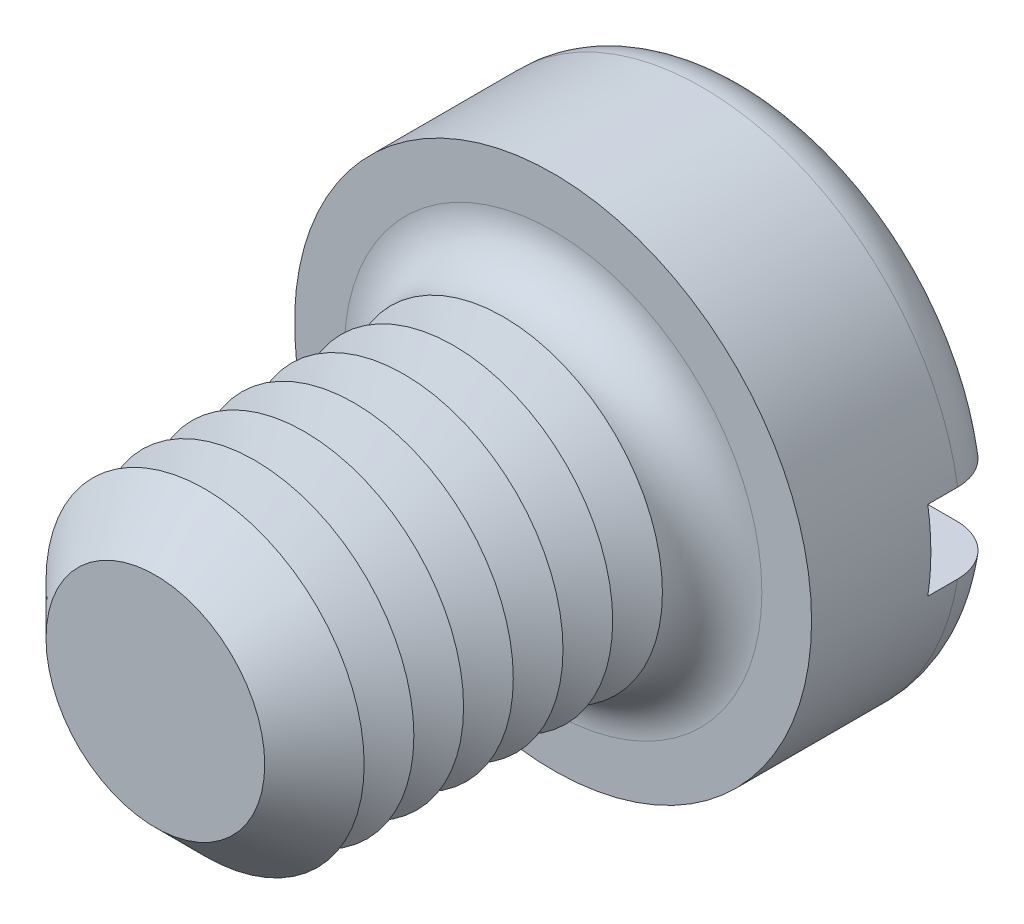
ISO-10303-21;
HEADER;
FILE_DESCRIPTION(('STEP AP214'),'2;1');
FILE_NAME('part.step','',(''),(''),'','','');
FILE_SCHEMA(('AUTOMOTIVE_DESIGN { 1 0 10303 214 1 1 1 1 }'));
ENDSEC;
DATA;
#1=APPLICATION_CONTEXT('core data for automotive mechanical design processes');
#2=APPLICATION_PROTOCOL_DEFINITION('international standard','automotive_design',2000,#1);
#3=PRODUCT_CONTEXT('',#1,'mechanical');
#4=PRODUCT('Part','Part','',(#3));
#5=PRODUCT_RELATED_PRODUCT_CATEGORY('part','',(#4));
#6=PRODUCT_DEFINITION_FORMATION('','',#4);
#7=PRODUCT_DEFINITION_CONTEXT('part definition',#1,'design');
#8=PRODUCT_DEFINITION('design','',#6,#7);
#9=PRODUCT_DEFINITION_SHAPE('','',#8);
#10=(LENGTH_UNIT() NAMED_UNIT(*) SI_UNIT(.MILLI.,.METRE.));
#11=(NAMED_UNIT(*) PLANE_ANGLE_UNIT() SI_UNIT($,.RADIAN.));
#12=(NAMED_UNIT(*) SI_UNIT($,.STERADIAN.) SOLID_ANGLE_UNIT());
#13=UNCERTAINTY_MEASURE_WITH_UNIT(LENGTH_MEASURE(1.E-05),#10,'distance_accuracy_value','');
#14=(GEOMETRIC_REPRESENTATION_CONTEXT(3) GLOBAL_UNCERTAINTY_ASSIGNED_CONTEXT((#13)) GLOBAL_UNIT_ASSIGNED_CONTEXT((#10,
#11,#12)) REPRESENTATION_CONTEXT('',''));
#15=CARTESIAN_POINT('',(0.,0.,0.));
#16=DIRECTION('',(0.,0.,1.));
#17=DIRECTION('',(1.,0.,0.));
#18=AXIS2_PLACEMENT_3D('',#15,#16,#17);
#19=CARTESIAN_POINT('',(0.,0.,-5.));
#20=DIRECTION('',(0.,0.,1.));
#21=DIRECTION('',(1.,0.,0.));
#22=AXIS2_PLACEMENT_3D('',#19,#20,#21);
#23=PLANE('',#22);
#24=CARTESIAN_POINT('',(0.,0.,-5.));
#25=DIRECTION('',(0.,0.,1.));
#26=DIRECTION('',(1.,0.,0.));
#27=AXIS2_PLACEMENT_3D('',#24,#25,#26);
#28=CIRCLE('',#27,5.25);
#29=CARTESIAN_POINT('',(-5.15388203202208,1.,-5.));
#30=VERTEX_POINT('',#29);
#31=CARTESIAN_POINT('',(5.15388203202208,0.999999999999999,-5.));
#32=VERTEX_POINT('',#31);
#33=EDGE_CURVE('E116',#30,#32,#28,.F.);
#34=ORIENTED_EDGE('',*,*,#33,.T.);
#35=DIRECTION('',(1.,0.,0.));
#36=VECTOR('',#35,1.);
#37=CARTESIAN_POINT('',(-6.5,1.,-5.));
#38=LINE('',#37,#36);
#39=EDGE_CURVE('E111',#30,#32,#38,.T.);
#40=ORIENTED_EDGE('',*,*,#39,.F.);
#41=EDGE_LOOP('',(#34,#40));
#42=FACE_BOUND('',#41,.T.);
#43=ADVANCED_FACE('F39',(#42),#23,.F.);
#44=CARTESIAN_POINT('',(0.,0.,-3.75));
#45=DIRECTION('',(0.,0.,1.));
#46=DIRECTION('',(1.,0.,0.));
#47=AXIS2_PLACEMENT_3D('',#44,#45,#46);
#48=TOROIDAL_SURFACE('',#47,5.25,1.25);
#49=CARTESIAN_POINT('',(-6.04655789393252,1.,-4.63904490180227));
#50=CARTESIAN_POINT('',(-5.99546860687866,1.,-4.68885774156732));
#51=CARTESIAN_POINT('',(-5.94008472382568,1.,-4.73434760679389));
#52=CARTESIAN_POINT('',(-5.8223927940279,1.,-4.81538052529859));
#53=CARTESIAN_POINT('',(-5.7600753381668,1.,-4.85090982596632));
#54=CARTESIAN_POINT('',(-5.63044351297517,1.,-4.91100606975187));
#55=CARTESIAN_POINT('',(-5.56313479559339,1.,-4.93558519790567));
#56=CARTESIAN_POINT('',(-5.42539577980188,1.,-4.97322457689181));
#57=CARTESIAN_POINT('',(-5.35496625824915,1.,-4.98628767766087));
#58=CARTESIAN_POINT('',(-5.21212635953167,1.,-5.00070478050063));
#59=CARTESIAN_POINT('',(-5.13970265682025,1.,-5.00192674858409));
#60=CARTESIAN_POINT('',(-4.99565121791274,1.,-4.99234085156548));
#61=CARTESIAN_POINT('',(-4.92402357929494,1.,-4.98153152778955));
#62=CARTESIAN_POINT('',(-4.78274786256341,1.,-4.94801424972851));
#63=CARTESIAN_POINT('',(-4.71313137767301,1.,-4.92517296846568));
#64=CARTESIAN_POINT('',(-4.57871041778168,1.,-4.86813760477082));
#65=CARTESIAN_POINT('',(-4.51390612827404,1.,-4.83394308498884));
#66=CARTESIAN_POINT('',(-4.39095493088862,1.,-4.75508341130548));
#67=CARTESIAN_POINT('',(-4.33281197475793,1.,-4.7104120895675));
#68=CARTESIAN_POINT('',(-4.2249980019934,1.,-4.61179869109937));
#69=CARTESIAN_POINT('',(-4.17532640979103,1.,-4.55785724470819));
#70=CARTESIAN_POINT('',(-4.08677450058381,1.,-4.4431082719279));
#71=CARTESIAN_POINT('',(-4.0477350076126,1.,-4.38242369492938));
#72=CARTESIAN_POINT('',(-3.98074296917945,1.,-4.25521412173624));
#73=CARTESIAN_POINT('',(-3.95278836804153,1.,-4.18869021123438));
#74=CARTESIAN_POINT('',(-3.90959497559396,1.,-4.0537026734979));
#75=CARTESIAN_POINT('',(-3.89401985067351,1.,-3.98534663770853));
#76=CARTESIAN_POINT('',(-3.8748586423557,1.,-3.84697740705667));
#77=CARTESIAN_POINT('',(-3.87127067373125,1.,-3.7769644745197));
#78=CARTESIAN_POINT('',(-3.8761573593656,1.,-3.63892215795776));
#79=CARTESIAN_POINT('',(-3.88436651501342,1.,-3.57088319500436));
#80=CARTESIAN_POINT('',(-3.91207743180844,1.,-3.43714958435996));
#81=CARTESIAN_POINT('',(-3.93157911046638,1.,-3.37145491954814));
#82=CARTESIAN_POINT('',(-3.98125045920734,1.,-3.24411474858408));
#83=CARTESIAN_POINT('',(-4.01143761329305,1.,-3.18247607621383));
#84=CARTESIAN_POINT('',(-4.08150210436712,1.,-3.064981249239));
#85=CARTESIAN_POINT('',(-4.12138048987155,1.,-3.0091257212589));
#86=CARTESIAN_POINT('',(-4.2106718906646,1.,-2.90336353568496));
#87=CARTESIAN_POINT('',(-4.26028693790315,1.,-2.85362751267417));
#88=CARTESIAN_POINT('',(-4.36696587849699,1.,-2.76291710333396));
#89=CARTESIAN_POINT('',(-4.42403082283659,1.,-2.72194395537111));
#90=CARTESIAN_POINT('',(-4.54567957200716,1.,-2.64877280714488));
#91=CARTESIAN_POINT('',(-4.61042643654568,1.,-2.61684571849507));
#92=CARTESIAN_POINT('',(-4.74430563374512,1.,-2.56412359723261));
#93=CARTESIAN_POINT('',(-4.8134383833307,1.,-2.54332962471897));
#94=CARTESIAN_POINT('',(-4.95527237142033,1.,-2.51320471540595));
#95=CARTESIAN_POINT('',(-5.0280120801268,1.,-2.50405449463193));
#96=CARTESIAN_POINT('',(-5.17399775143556,1.,-2.49810126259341));
#97=CARTESIAN_POINT('',(-5.24724372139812,1.,-2.50129843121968));
#98=CARTESIAN_POINT('',(-5.3921014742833,1.,-2.52000776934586));
#99=CARTESIAN_POINT('',(-5.4637142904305,1.,-2.53551191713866));
#100=CARTESIAN_POINT('',(-5.60326680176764,1.,-2.57846304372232));
#101=CARTESIAN_POINT('',(-5.67120668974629,1.,-2.60590939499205));
#102=CARTESIAN_POINT('',(-5.80064060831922,1.,-2.67164926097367));
#103=CARTESIAN_POINT('',(-5.862199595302,1.,-2.70981484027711));
#104=CARTESIAN_POINT('',(-5.9779079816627,1.,-2.79608690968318));
#105=CARTESIAN_POINT('',(-6.03205795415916,1.,-2.84419263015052));
#106=CARTESIAN_POINT('',(-6.13055119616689,1.,-2.9482052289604));
#107=CARTESIAN_POINT('',(-6.17502887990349,1.,-3.00398483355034));
#108=CARTESIAN_POINT('',(-6.25384180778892,1.,-3.12230113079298));
#109=CARTESIAN_POINT('',(-6.28817779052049,1.,-3.18483733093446));
#110=CARTESIAN_POINT('',(-6.34527986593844,1.,-3.31401726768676));
#111=CARTESIAN_POINT('',(-6.36818984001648,1.,-3.38059742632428));
#112=CARTESIAN_POINT('',(-6.40240470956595,1.,-3.5166725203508));
#113=CARTESIAN_POINT('',(-6.41371067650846,1.,-3.58616718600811));
#114=CARTESIAN_POINT('',(-6.42433240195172,1.,-3.72550026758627));
#115=CARTESIAN_POINT('',(-6.4237441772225,1.,-3.79533138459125));
#116=CARTESIAN_POINT('',(-6.41082814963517,1.,-3.93391789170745));
#117=CARTESIAN_POINT('',(-6.39849757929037,1.,-4.00267302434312));
#118=CARTESIAN_POINT('',(-6.36249191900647,1.,-4.13704597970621));
#119=CARTESIAN_POINT('',(-6.33883072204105,1.,-4.20266753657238));
#120=CARTESIAN_POINT('',(-6.28088769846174,1.,-4.32897165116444));
#121=CARTESIAN_POINT('',(-6.24661890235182,1.,-4.38966015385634));
#122=CARTESIAN_POINT('',(-6.18404039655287,1.,-4.48163773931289));
#123=CARTESIAN_POINT('',(-6.15876600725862,1.,-4.51503333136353));
#124=CARTESIAN_POINT('',(-6.10500607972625,1.,-4.5791298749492));
#125=CARTESIAN_POINT('',(-6.07652056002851,1.,-4.60983084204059));
#126=CARTESIAN_POINT('',(-6.04655789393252,1.,-4.63904490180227));
#127=B_SPLINE_CURVE_WITH_KNOTS('',3,(#49,#50,#51,#52,#53,#54,#55,#56,#57,#58,#59,#60,#61,#62,
#63,#64,#65,#66,#67,#68,#69,#70,#71,#72,#73,#74,#75,#76,#77,#78,#79,#80,#81,#82,#83,#84,#85,#86,
#87,#88,#89,#90,#91,#92,#93,#94,#95,#96,#97,#98,#99,#100,#101,#102,#103,#104,#105,#106,#107,
#108,#109,#110,#111,#112,#113,#114,#115,#116,#117,#118,#119,#120,#121,#122,#123,#124,#125,#126),
.UNSPECIFIED.,.T.,.F.,(4,2,2,2,2,2,2,2,2,2,2,2,2,2,2,2,2,2,2,2,2,2,2,2,2,2,2,2,2,2,2,2,2,2,2,2,
2,2,4),(0.,0.213907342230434,0.428108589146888,0.64207088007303,0.855980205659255,
1.07227200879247,1.28859003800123,1.50735715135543,1.72613269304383,1.94503735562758,
2.16392713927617,2.37933295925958,2.59469881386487,2.80399176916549,3.01325180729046,
3.2178754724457,3.42249764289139,3.62745618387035,3.83243690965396,4.04223444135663,
4.25206160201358,4.46763253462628,4.68322399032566,4.90212226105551,5.12102372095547,
5.33978261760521,5.55853002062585,5.77477015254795,5.99099354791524,6.20398686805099,
6.41696467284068,6.62718821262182,6.83739233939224,7.0459002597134,7.25445733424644,
7.46275934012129,7.67080647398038,7.79625882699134,7.92171045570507),.UNSPECIFIED.);
#128=CARTESIAN_POINT('',(-6.42261628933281,1.,-3.74999999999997));
#129=VERTEX_POINT('',#128);
#130=EDGE_CURVE('E226',#129,#30,#127,.T.);
#131=ORIENTED_EDGE('',*,*,#130,.F.);
#132=CARTESIAN_POINT('',(0.,0.,-3.75));
#133=DIRECTION('',(0.,0.,1.));
#134=DIRECTION('',(1.,0.,0.));
#135=AXIS2_PLACEMENT_3D('',#132,#133,#134);
#136=CIRCLE('',#135,6.5);
#137=CARTESIAN_POINT('',(6.42261628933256,1.,-3.75));
#138=VERTEX_POINT('',#137);
#139=EDGE_CURVE('E124',#138,#129,#136,.T.);
#140=ORIENTED_EDGE('',*,*,#139,.F.);
#141=CARTESIAN_POINT('',(4.06944999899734,1.,-4.4133199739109));
#142=CARTESIAN_POINT('',(4.10828271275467,1.,-4.47354709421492));
#143=CARTESIAN_POINT('',(4.15233880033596,1.,-4.53047894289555));
#144=CARTESIAN_POINT('',(4.24946916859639,1.,-4.63614530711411));
#145=CARTESIAN_POINT('',(4.3025574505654,1.,-4.68486685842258));
#146=CARTESIAN_POINT('',(4.41603250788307,1.,-4.77271114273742));
#147=CARTESIAN_POINT('',(4.47640839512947,1.,-4.8118479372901));
#148=CARTESIAN_POINT('',(4.60277035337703,1.,-4.87959878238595));
#149=CARTESIAN_POINT('',(4.66875480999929,1.,-4.90821584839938));
#150=CARTESIAN_POINT('',(4.80558589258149,1.,-4.95456537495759));
#151=CARTESIAN_POINT('',(4.87649196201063,1.,-4.97212253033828));
#152=CARTESIAN_POINT('',(5.02024710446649,1.,-4.99514979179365));
#153=CARTESIAN_POINT('',(5.09309636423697,1.,-5.00061873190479));
#154=CARTESIAN_POINT('',(5.23902872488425,1.,-4.99926689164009));
#155=CARTESIAN_POINT('',(5.31211131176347,1.,-4.99238812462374));
#156=CARTESIAN_POINT('',(5.45605806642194,1.,-4.96635140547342));
#157=CARTESIAN_POINT('',(5.52692231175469,1.,-4.94719388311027));
#158=CARTESIAN_POINT('',(5.66376170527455,1.,-4.89728421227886));
#159=CARTESIAN_POINT('',(5.72977335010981,1.,-4.86663219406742));
#160=CARTESIAN_POINT('',(5.85560715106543,1.,-4.79452334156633));
#161=CARTESIAN_POINT('',(5.91542977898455,1.,-4.7530673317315));
#162=CARTESIAN_POINT('',(6.02626022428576,1.,-4.66116821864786));
#163=CARTESIAN_POINT('',(6.07738307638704,1.,-4.6108638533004));
#164=CARTESIAN_POINT('',(6.17030947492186,1.,-4.50227823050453));
#165=CARTESIAN_POINT('',(6.2121137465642,1.,-4.44399759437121));
#166=CARTESIAN_POINT('',(6.28460268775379,1.,-4.32200305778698));
#167=CARTESIAN_POINT('',(6.31543589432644,1.,-4.2583773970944));
#168=CARTESIAN_POINT('',(6.36586009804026,1.,-4.12681721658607));
#169=CARTESIAN_POINT('',(6.38545178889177,1.,-4.0588829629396));
#170=CARTESIAN_POINT('',(6.41265760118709,1.,-3.92136007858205));
#171=CARTESIAN_POINT('',(6.42038873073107,1.,-3.85179457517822));
#172=CARTESIAN_POINT('',(6.42401070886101,1.,-3.7123569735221));
#173=CARTESIAN_POINT('',(6.41990193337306,1.,-3.64248488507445));
#174=CARTESIAN_POINT('',(6.40000894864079,1.,-3.50470871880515));
#175=CARTESIAN_POINT('',(6.38427119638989,1.,-3.43679792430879));
#176=CARTESIAN_POINT('',(6.34164491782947,1.,-3.30457296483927));
#177=CARTESIAN_POINT('',(6.31475638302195,1.,-3.24025880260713));
#178=CARTESIAN_POINT('',(6.2505455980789,1.,-3.11686791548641));
#179=CARTESIAN_POINT('',(6.21319759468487,1.,-3.05780459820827));
#180=CARTESIAN_POINT('',(6.12919411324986,1.,-2.94671919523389));
#181=CARTESIAN_POINT('',(6.08253833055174,1.,-2.89469734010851));
#182=CARTESIAN_POINT('',(5.98083387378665,1.,-2.79868150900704));
#183=CARTESIAN_POINT('',(5.92571704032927,1.,-2.75475975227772));
#184=CARTESIAN_POINT('',(5.80897194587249,1.,-2.67665277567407));
#185=CARTESIAN_POINT('',(5.74734329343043,1.,-2.64246814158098));
#186=CARTESIAN_POINT('',(5.6184644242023,1.,-2.58431810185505));
#187=CARTESIAN_POINT('',(5.55115102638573,1.,-2.56049275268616));
#188=CARTESIAN_POINT('',(5.41351272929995,1.,-2.52429868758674));
#189=CARTESIAN_POINT('',(5.34318759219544,1.,-2.51193087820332));
#190=CARTESIAN_POINT('',(5.20041507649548,1.,-2.49882112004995));
#191=CARTESIAN_POINT('',(5.12795169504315,1.,-2.49825332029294));
#192=CARTESIAN_POINT('',(4.98393373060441,1.,-2.50914771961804));
#193=CARTESIAN_POINT('',(4.91237921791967,1.,-2.52061084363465));
#194=CARTESIAN_POINT('',(4.77137358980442,1.,-2.55542281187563));
#195=CARTESIAN_POINT('',(4.70195472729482,1.,-2.57890245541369));
#196=CARTESIAN_POINT('',(4.56803538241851,1.,-2.63717701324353));
#197=CARTESIAN_POINT('',(4.50353509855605,1.,-2.67197238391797));
#198=CARTESIAN_POINT('',(4.38131858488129,1.,-2.7519648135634));
#199=CARTESIAN_POINT('',(4.32360365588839,1.,-2.79716386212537));
#200=CARTESIAN_POINT('',(4.21673400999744,1.,-2.89675634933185));
#201=CARTESIAN_POINT('',(4.16757871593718,1.,-2.95114916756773));
#202=CARTESIAN_POINT('',(4.08014713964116,1.,-3.06667703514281));
#203=CARTESIAN_POINT('',(4.04170608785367,1.,-3.12768727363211));
#204=CARTESIAN_POINT('',(3.97596192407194,1.,-3.25543782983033));
#205=CARTESIAN_POINT('',(3.94865624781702,1.,-3.32217682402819));
#206=CARTESIAN_POINT('',(3.9067737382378,1.,-3.45745603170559));
#207=CARTESIAN_POINT('',(3.89185707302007,1.,-3.52589108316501));
#208=CARTESIAN_POINT('',(3.87400755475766,1.,-3.66432360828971));
#209=CARTESIAN_POINT('',(3.87107601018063,1.,-3.73432125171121));
#210=CARTESIAN_POINT('',(3.8772387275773,1.,-3.87228267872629));
#211=CARTESIAN_POINT('',(3.88607933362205,1.,-3.94025811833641));
#212=CARTESIAN_POINT('',(3.91502769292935,1.,-4.07370133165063));
#213=CARTESIAN_POINT('',(3.93512131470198,1.,-4.1391721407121));
#214=CARTESIAN_POINT('',(3.9752037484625,1.,-4.23926719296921));
#215=CARTESIAN_POINT('',(3.99171171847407,1.,-4.27532618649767));
#216=CARTESIAN_POINT('',(4.02809737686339,1.,-4.34569933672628));
#217=CARTESIAN_POINT('',(4.04797497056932,1.,-4.3800135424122));
#218=CARTESIAN_POINT('',(4.06944999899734,1.,-4.4133199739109));
#219=B_SPLINE_CURVE_WITH_KNOTS('',3,(#141,#142,#143,#144,#145,#146,#147,#148,#149,#150,#151,
#152,#153,#154,#155,#156,#157,#158,#159,#160,#161,#162,#163,#164,#165,#166,#167,#168,#169,#170,
#171,#172,#173,#174,#175,#176,#177,#178,#179,#180,#181,#182,#183,#184,#185,#186,#187,#188,#189,
#190,#191,#192,#193,#194,#195,#196,#197,#198,#199,#200,#201,#202,#203,#204,#205,#206,#207,#208,
#209,#210,#211,#212,#213,#214,#215,#216,#217,#218),.UNSPECIFIED.,.T.,.F.,(4,2,2,2,2,2,2,2,2,2,2,
2,2,2,2,2,2,2,2,2,2,2,2,2,2,2,2,2,2,2,2,2,2,2,2,2,2,2,4),(0.,0.214833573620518,
0.430003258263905,0.644855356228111,0.859645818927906,1.0777603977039,1.29589601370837,
1.51505870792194,1.73421373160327,1.95150241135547,2.16877451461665,2.38290237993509,
2.59701357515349,2.8081044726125,3.01918234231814,3.22816416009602,3.43713934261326,
3.64528416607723,3.85342914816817,4.06209119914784,4.27076008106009,4.48120788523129,
4.69166834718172,4.90489186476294,5.11813225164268,5.33451752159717,5.55091942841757,
5.76972860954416,5.98854661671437,6.20740650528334,6.42625163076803,6.64151774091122,
6.85673425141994,7.0658317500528,7.27495207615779,7.47963858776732,7.68406862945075,
7.80287790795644,7.92168384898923),.UNSPECIFIED.);
#220=EDGE_CURVE('E228',#32,#138,#219,.T.);
#221=ORIENTED_EDGE('',*,*,#220,.F.);
#222=ORIENTED_EDGE('',*,*,#33,.F.);
#223=EDGE_LOOP('',(#131,#140,#221,#222));
#224=FACE_BOUND('',#223,.T.);
#225=ADVANCED_FACE('F210',(#224),#48,.T.);
#226=CARTESIAN_POINT('',(0.,0.,-5.));
#227=DIRECTION('',(0.,0.,1.));
#228=DIRECTION('',(1.,0.,0.));
#229=AXIS2_PLACEMENT_3D('',#226,#227,#228);
#230=CYLINDRICAL_SURFACE('',#229,6.5);
#231=DIRECTION('',(0.,0.,1.));
#232=VECTOR('',#231,1.);
#233=CARTESIAN_POINT('',(6.42261628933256,1.,-5.));
#234=LINE('',#233,#232);
#235=CARTESIAN_POINT('',(6.42261628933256,0.999999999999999,-3.));
#236=VERTEX_POINT('',#235);
#237=EDGE_CURVE('E242',#138,#236,#234,.T.);
#238=ORIENTED_EDGE('',*,*,#237,.F.);
#239=ORIENTED_EDGE('',*,*,#139,.T.);
#240=DIRECTION('',(0.,0.,1.));
#241=VECTOR('',#240,1.);
#242=CARTESIAN_POINT('',(-6.42261628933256,1.,-5.));
#243=LINE('',#242,#241);
#244=CARTESIAN_POINT('',(-6.42261628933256,1.,-3.));
#245=VERTEX_POINT('',#244);
#246=EDGE_CURVE('E63',#245,#129,#243,.F.);
#247=ORIENTED_EDGE('',*,*,#246,.F.);
#248=CARTESIAN_POINT('',(0.,0.,-3.));
#249=DIRECTION('',(0.,0.,-1.));
#250=DIRECTION('',(-1.,0.,0.));
#251=AXIS2_PLACEMENT_3D('',#248,#249,#250);
#252=CIRCLE('',#251,6.5);
#253=CARTESIAN_POINT('',(-6.42261628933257,-0.999999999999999,-3.));
#254=VERTEX_POINT('',#253);
#255=EDGE_CURVE('E43',#245,#254,#252,.F.);
#256=ORIENTED_EDGE('',*,*,#255,.T.);
#257=DIRECTION('',(0.,0.,1.));
#258=VECTOR('',#257,1.);
#259=CARTESIAN_POINT('',(-6.42261628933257,-0.999999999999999,-5.));
#260=LINE('',#259,#258);
#261=CARTESIAN_POINT('',(-6.42261628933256,-0.999999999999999,-3.75));
#262=VERTEX_POINT('',#261);
#263=EDGE_CURVE('E239',#262,#254,#260,.T.);
#264=ORIENTED_EDGE('',*,*,#263,.F.);
#265=CARTESIAN_POINT('',(6.42261628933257,-1.,-3.75));
#266=VERTEX_POINT('',#265);
#267=EDGE_CURVE('E126',#262,#266,#136,.T.);
#268=ORIENTED_EDGE('',*,*,#267,.T.);
#269=DIRECTION('',(0.,0.,1.));
#270=VECTOR('',#269,1.);
#271=CARTESIAN_POINT('',(6.42261628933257,-1.,-5.));
#272=LINE('',#271,#270);
#273=CARTESIAN_POINT('',(6.42261628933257,-1.,-3.));
#274=VERTEX_POINT('',#273);
#275=EDGE_CURVE('E55',#274,#266,#272,.F.);
#276=ORIENTED_EDGE('',*,*,#275,.F.);
#277=EDGE_CURVE('E11',#274,#236,#252,.F.);
#278=ORIENTED_EDGE('',*,*,#277,.T.);
#279=EDGE_LOOP('',(#238,#239,#247,#256,#264,#268,#276,#278));
#280=FACE_BOUND('',#279,.T.);
#281=CARTESIAN_POINT('',(0.,0.,0.));
#282=DIRECTION('',(0.,0.,1.));
#283=DIRECTION('',(1.,0.,0.));
#284=AXIS2_PLACEMENT_3D('',#281,#282,#283);
#285=CIRCLE('',#284,6.5);
#286=CARTESIAN_POINT('',(6.5,0.,0.));
#287=VERTEX_POINT('',#286);
#288=EDGE_CURVE('E245',#287,#287,#285,.T.);
#289=ORIENTED_EDGE('',*,*,#288,.F.);
#290=EDGE_LOOP('',(#289));
#291=FACE_BOUND('',#290,.T.);
#292=ADVANCED_FACE('F206',(#280,#291),#230,.T.);
#293=CARTESIAN_POINT('',(5.15388203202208,-1.,-5.));
#294=VERTEX_POINT('',#293);
#295=CARTESIAN_POINT('',(-5.15388203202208,-0.999999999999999,-5.));
#296=VERTEX_POINT('',#295);
#297=EDGE_CURVE('E109',#294,#296,#28,.F.);
#298=ORIENTED_EDGE('',*,*,#297,.T.);
#299=DIRECTION('',(-1.,0.,0.));
#300=VECTOR('',#299,1.);
#301=CARTESIAN_POINT('',(-6.5,-0.999999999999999,-5.));
#302=LINE('',#301,#300);
#303=EDGE_CURVE('E96',#294,#296,#302,.T.);
#304=ORIENTED_EDGE('',*,*,#303,.F.);
#305=EDGE_LOOP('',(#298,#304));
#306=FACE_BOUND('',#305,.T.);
#307=ADVANCED_FACE('F108',(#306),#23,.F.);
#308=CARTESIAN_POINT('',(0.,0.,0.));
#309=DIRECTION('',(0.,0.,1.));
#310=DIRECTION('',(1.,0.,0.));
#311=AXIS2_PLACEMENT_3D('',#308,#309,#310);
#312=PLANE('',#311);
#313=CARTESIAN_POINT('',(0.,0.,0.));
#314=DIRECTION('',(0.,0.,1.));
#315=DIRECTION('',(1.,0.,0.));
#316=AXIS2_PLACEMENT_3D('',#313,#314,#315);
#317=CIRCLE('',#316,5.25);
#318=CARTESIAN_POINT('',(5.25,0.,0.));
#319=VERTEX_POINT('',#318);
#320=EDGE_CURVE('E115',#319,#319,#317,.F.);
#321=ORIENTED_EDGE('',*,*,#320,.T.);
#322=EDGE_LOOP('',(#321));
#323=FACE_BOUND('',#322,.T.);
#324=ORIENTED_EDGE('',*,*,#288,.T.);
#325=EDGE_LOOP('',(#324));
#326=FACE_BOUND('',#325,.T.);
#327=ADVANCED_FACE('F205',(#323,#326),#312,.T.);
#328=CARTESIAN_POINT('',(-6.04655789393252,-0.999999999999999,-4.63904490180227));
#329=CARTESIAN_POINT('',(-6.0966604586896,-0.999999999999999,-4.59018532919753));
#330=CARTESIAN_POINT('',(-6.14270501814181,-0.999999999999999,-4.53709744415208));
#331=CARTESIAN_POINT('',(-6.22528519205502,-0.999999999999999,-4.42391631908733));
#332=CARTESIAN_POINT('',(-6.26181074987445,-0.999999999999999,-4.36381576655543));
#333=CARTESIAN_POINT('',(-6.32422109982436,-0.999999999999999,-4.23831836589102));
#334=CARTESIAN_POINT('',(-6.35010658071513,-0.999999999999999,-4.17292186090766));
#335=CARTESIAN_POINT('',(-6.39044668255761,-0.999999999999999,-4.03870925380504));
#336=CARTESIAN_POINT('',(-6.40490396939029,-0.999999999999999,-3.96989395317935));
#337=CARTESIAN_POINT('',(-6.42190814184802,-0.999999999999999,-3.83122595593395));
#338=CARTESIAN_POINT('',(-6.4245257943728,-0.999999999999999,-3.76138193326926));
#339=CARTESIAN_POINT('',(-6.41796432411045,-0.999999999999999,-3.62224935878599));
#340=CARTESIAN_POINT('',(-6.40878509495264,-0.999999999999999,-3.55296081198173));
#341=CARTESIAN_POINT('',(-6.37894560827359,-0.999999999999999,-3.41709241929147));
#342=CARTESIAN_POINT('',(-6.35831520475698,-0.999999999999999,-3.35050601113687));
#343=CARTESIAN_POINT('',(-6.30620980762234,-0.999999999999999,-3.22172312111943));
#344=CARTESIAN_POINT('',(-6.2747347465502,-0.999999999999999,-3.15952666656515));
#345=CARTESIAN_POINT('',(-6.20172710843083,-0.999999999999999,-3.04101762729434));
#346=CARTESIAN_POINT('',(-6.16015622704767,-0.999999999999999,-2.98472864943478));
#347=CARTESIAN_POINT('',(-6.06823774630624,-0.999999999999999,-2.87984578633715));
#348=CARTESIAN_POINT('',(-6.01788981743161,-0.999999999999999,-2.83125219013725));
#349=CARTESIAN_POINT('',(-5.90933830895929,-0.999999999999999,-2.74262118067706));
#350=CARTESIAN_POINT('',(-5.85106338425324,-0.999999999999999,-2.70267117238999));
#351=CARTESIAN_POINT('',(-5.72870702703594,-0.999999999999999,-2.63296796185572));
#352=CARTESIAN_POINT('',(-5.66462521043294,-0.999999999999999,-2.6032154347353));
#353=CARTESIAN_POINT('',(-5.53153273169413,-0.999999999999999,-2.55430842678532));
#354=CARTESIAN_POINT('',(-5.46246626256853,-0.999999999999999,-2.53530583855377));
#355=CARTESIAN_POINT('',(-5.32214267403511,-0.999999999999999,-2.5089831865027));
#356=CARTESIAN_POINT('',(-5.25088537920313,-0.999999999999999,-2.50166406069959));
#357=CARTESIAN_POINT('',(-5.10710123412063,-0.999999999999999,-2.49882202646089));
#358=CARTESIAN_POINT('',(-5.03457095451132,-0.999999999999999,-2.50347166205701));
#359=CARTESIAN_POINT('',(-4.8912897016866,-0.999999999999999,-2.52476029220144));
#360=CARTESIAN_POINT('',(-4.82053886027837,-0.999999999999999,-2.54140017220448));
#361=CARTESIAN_POINT('',(-4.68213257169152,-0.999999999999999,-2.586416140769));
#362=CARTESIAN_POINT('',(-4.61451256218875,-0.999999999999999,-2.61490131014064));
#363=CARTESIAN_POINT('',(-4.48502801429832,-0.999999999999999,-2.68285095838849));
#364=CARTESIAN_POINT('',(-4.42316359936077,-0.999999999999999,-2.72231567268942));
#365=CARTESIAN_POINT('',(-4.30720694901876,-0.999999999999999,-2.81103994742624));
#366=CARTESIAN_POINT('',(-4.25309118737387,-0.999999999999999,-2.86026872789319));
#367=CARTESIAN_POINT('',(-4.1540940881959,-0.999999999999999,-2.96727648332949));
#368=CARTESIAN_POINT('',(-4.10921182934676,-0.999999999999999,-3.02505460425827));
#369=CARTESIAN_POINT('',(-4.03096584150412,-0.999999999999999,-3.14632492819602));
#370=CARTESIAN_POINT('',(-3.99739097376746,-0.999999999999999,-3.2096807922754));
#371=CARTESIAN_POINT('',(-3.94171839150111,-0.999999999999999,-3.34124912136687));
#372=CARTESIAN_POINT('',(-3.91961840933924,-0.999999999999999,-3.40946062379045));
#373=CARTESIAN_POINT('',(-3.88816636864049,-0.999999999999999,-3.54669256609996));
#374=CARTESIAN_POINT('',(-3.87846562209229,-0.999999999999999,-3.61563318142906));
#375=CARTESIAN_POINT('',(-3.87100568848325,-0.999999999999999,-3.75415397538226));
#376=CARTESIAN_POINT('',(-3.87324501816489,-0.999999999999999,-3.82373407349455));
#377=CARTESIAN_POINT('',(-3.88943589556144,-0.999999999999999,-3.96027701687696));
#378=CARTESIAN_POINT('',(-3.90318225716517,-0.999999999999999,-4.0272643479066));
#379=CARTESIAN_POINT('',(-3.94163954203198,-0.999999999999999,-4.1580093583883));
#380=CARTESIAN_POINT('',(-3.96635075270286,-0.999999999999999,-4.22176695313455));
#381=CARTESIAN_POINT('',(-4.026160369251,-0.999999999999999,-4.34483320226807));
#382=CARTESIAN_POINT('',(-4.06134035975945,-0.999999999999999,-4.40410214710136));
#383=CARTESIAN_POINT('',(-4.14090865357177,-0.999999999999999,-4.51609417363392));
#384=CARTESIAN_POINT('',(-4.18529811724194,-0.999999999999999,-4.56881642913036));
#385=CARTESIAN_POINT('',(-4.2832649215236,-0.999999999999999,-4.66770177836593));
#386=CARTESIAN_POINT('',(-4.33705327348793,-0.999999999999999,-4.71365579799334));
#387=CARTESIAN_POINT('',(-4.45141776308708,-0.999999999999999,-4.79615385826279));
#388=CARTESIAN_POINT('',(-4.51199483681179,-0.999999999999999,-4.83269659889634));
#389=CARTESIAN_POINT('',(-4.63989216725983,-0.999999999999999,-4.89626962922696));
#390=CARTESIAN_POINT('',(-4.70734508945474,-0.999999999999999,-4.92303326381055));
#391=CARTESIAN_POINT('',(-4.84575497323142,-0.999999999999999,-4.96500199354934));
#392=CARTESIAN_POINT('',(-4.91671207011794,-0.999999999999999,-4.98020664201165));
#393=CARTESIAN_POINT('',(-5.06097761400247,-0.999999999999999,-4.9987306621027));
#394=CARTESIAN_POINT('',(-5.13430353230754,-0.999999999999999,-5.00191441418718));
#395=CARTESIAN_POINT('',(-5.28046546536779,-0.999999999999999,-4.99587686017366));
#396=CARTESIAN_POINT('',(-5.35330135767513,-0.999999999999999,-4.98665256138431));
#397=CARTESIAN_POINT('',(-5.49610354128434,-0.999999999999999,-4.95604184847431));
#398=CARTESIAN_POINT('',(-5.56607890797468,-0.999999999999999,-4.93469772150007));
#399=CARTESIAN_POINT('',(-5.70131538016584,-0.999999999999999,-4.8804195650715));
#400=CARTESIAN_POINT('',(-5.76658233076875,-0.999999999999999,-4.84750021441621));
#401=CARTESIAN_POINT('',(-5.86782577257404,-0.999999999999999,-4.78498748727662));
#402=CARTESIAN_POINT('',(-5.90579749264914,-0.999999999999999,-4.75856648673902));
#403=CARTESIAN_POINT('',(-5.97862186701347,-0.999999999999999,-4.70172646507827));
#404=CARTESIAN_POINT('',(-6.0134745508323,-0.999999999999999,-4.6713074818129));
#405=CARTESIAN_POINT('',(-6.04655789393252,-0.999999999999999,-4.63904490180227));
#406=B_SPLINE_CURVE_WITH_KNOTS('',3,(#328,#329,#330,#331,#332,#333,#334,#335,#336,#337,#338,
#339,#340,#341,#342,#343,#344,#345,#346,#347,#348,#349,#350,#351,#352,#353,#354,#355,#356,#357,
#358,#359,#360,#361,#362,#363,#364,#365,#366,#367,#368,#369,#370,#371,#372,#373,#374,#375,#376,
#377,#378,#379,#380,#381,#382,#383,#384,#385,#386,#387,#388,#389,#390,#391,#392,#393,#394,#395,
#396,#397,#398,#399,#400,#401,#402,#403,#404,#405),.UNSPECIFIED.,.T.,.F.,(4,2,2,2,2,2,2,2,2,2,2,
2,2,2,2,2,2,2,2,2,2,2,2,2,2,2,2,2,2,2,2,2,2,2,2,2,2,2,4),(0.,0.209780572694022,
0.419781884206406,0.62976959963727,0.839708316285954,1.04839053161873,1.2570746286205,
1.46521720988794,1.67336108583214,1.88230736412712,2.09126148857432,2.30223890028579,
2.51323027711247,2.72713284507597,2.94105258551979,3.15807345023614,3.37511034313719,
3.59419176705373,3.81327788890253,4.03168404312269,4.25006839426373,4.46411376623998,
4.67811682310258,4.88595885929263,5.09377507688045,5.29796268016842,5.50215563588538,
5.70798353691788,5.91383738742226,6.12510741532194,6.33640661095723,6.55309998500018,
6.76980173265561,6.98894112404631,7.20813337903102,7.42656551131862,7.64472163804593,
7.78324365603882,7.92176436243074),.UNSPECIFIED.);
#407=EDGE_CURVE('E103',#296,#262,#406,.T.);
#408=ORIENTED_EDGE('',*,*,#407,.F.);
#409=ORIENTED_EDGE('',*,*,#297,.F.);
#410=CARTESIAN_POINT('',(4.06944999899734,-1.,-4.4133199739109));
#411=CARTESIAN_POINT('',(4.03213207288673,-1.,-4.3554312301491));
#412=CARTESIAN_POINT('',(3.9995849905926,-1.,-4.29441722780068));
#413=CARTESIAN_POINT('',(3.94511822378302,-1.,-4.16776604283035));
#414=CARTESIAN_POINT('',(3.92320762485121,-1.,-4.10212496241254));
#415=CARTESIAN_POINT('',(3.89078811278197,-1.,-3.96804412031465));
#416=CARTESIAN_POINT('',(3.88028409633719,-1.,-3.89960316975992));
#417=CARTESIAN_POINT('',(3.87107895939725,-1.,-3.76194650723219));
#418=CARTESIAN_POINT('',(3.87237511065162,-1.,-3.69273097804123));
#419=CARTESIAN_POINT('',(3.88662927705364,-1.,-3.55634460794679));
#420=CARTESIAN_POINT('',(3.89944923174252,-1.,-3.48915926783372));
#421=CARTESIAN_POINT('',(3.93611188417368,-1.,-3.35786953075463));
#422=CARTESIAN_POINT('',(3.95995518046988,-1.,-3.29376530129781));
#423=CARTESIAN_POINT('',(4.0180748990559,-1.,-3.16993562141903));
#424=CARTESIAN_POINT('',(4.05242297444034,-1.,-3.11024385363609));
#425=CARTESIAN_POINT('',(4.13041121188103,-1.,-2.9972793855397));
#426=CARTESIAN_POINT('',(4.17405248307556,-1.,-2.94400745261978));
#427=CARTESIAN_POINT('',(4.27058636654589,-1.,-2.8439150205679));
#428=CARTESIAN_POINT('',(4.32368948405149,-1.,-2.79729757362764));
#429=CARTESIAN_POINT('',(4.43679856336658,-1.,-2.71336600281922));
#430=CARTESIAN_POINT('',(4.49680546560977,-1.,-2.67605314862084));
#431=CARTESIAN_POINT('',(4.62370121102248,-1.,-2.61081752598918));
#432=CARTESIAN_POINT('',(4.69072799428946,-1.,-2.58316284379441));
#433=CARTESIAN_POINT('',(4.82843981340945,-1.,-2.5393441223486));
#434=CARTESIAN_POINT('',(4.899125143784,-1.,-2.52318100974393));
#435=CARTESIAN_POINT('',(5.04306377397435,-1.,-2.50267755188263));
#436=CARTESIAN_POINT('',(5.11633773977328,-1.,-2.49848181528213));
#437=CARTESIAN_POINT('',(5.26254809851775,-1.,-2.50249357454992));
#438=CARTESIAN_POINT('',(5.33548449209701,-1.,-2.51070104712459));
#439=CARTESIAN_POINT('',(5.4786703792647,-1.,-2.53930888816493));
#440=CARTESIAN_POINT('',(5.54892819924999,-1.,-2.5596675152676));
#441=CARTESIAN_POINT('',(5.68495799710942,-1.,-2.61204238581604));
#442=CARTESIAN_POINT('',(5.75073024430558,-1.,-2.64405792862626));
#443=CARTESIAN_POINT('',(5.8750178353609,-1.,-2.7184150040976));
#444=CARTESIAN_POINT('',(5.93361487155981,-1.,-2.76061995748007));
#445=CARTESIAN_POINT('',(6.04275377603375,-1.,-2.85440601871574));
#446=CARTESIAN_POINT('',(6.09329629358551,-1.,-2.90598637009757));
#447=CARTESIAN_POINT('',(6.18409572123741,-1.,-3.01622977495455));
#448=CARTESIAN_POINT('',(6.2244945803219,-1.,-3.07477592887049));
#449=CARTESIAN_POINT('',(6.29474798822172,-1.,-3.19788594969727));
#450=CARTESIAN_POINT('',(6.3246032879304,-1.,-3.26244938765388));
#451=CARTESIAN_POINT('',(6.37256001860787,-1.,-3.39491634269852));
#452=CARTESIAN_POINT('',(6.39079949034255,-1.,-3.46276990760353));
#453=CARTESIAN_POINT('',(6.41554133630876,-1.,-3.60058363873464));
#454=CARTESIAN_POINT('',(6.42204424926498,-1.,-3.67054370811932));
#455=CARTESIAN_POINT('',(6.42311237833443,-1.,-3.81007982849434));
#456=CARTESIAN_POINT('',(6.41775799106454,-1.,-3.879655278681));
#457=CARTESIAN_POINT('',(6.39543799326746,-1.,-4.01691664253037));
#458=CARTESIAN_POINT('',(6.3784725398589,-1.,-4.08460258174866));
#459=CARTESIAN_POINT('',(6.33344768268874,-1.,-4.21614537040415));
#460=CARTESIAN_POINT('',(6.30539273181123,-1.,-4.28000374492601));
#461=CARTESIAN_POINT('',(6.23902076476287,-1.,-4.40214140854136));
#462=CARTESIAN_POINT('',(6.20070356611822,-1.,-4.46042059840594));
#463=CARTESIAN_POINT('',(6.11467174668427,-1.,-4.5701315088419));
#464=CARTESIAN_POINT('',(6.06690270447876,-1.,-4.62152053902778));
#465=CARTESIAN_POINT('',(5.96350111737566,-1.,-4.715657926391));
#466=CARTESIAN_POINT('',(5.90786817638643,-1.,-4.75840584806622));
#467=CARTESIAN_POINT('',(5.78965380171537,-1.,-4.8345781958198));
#468=CARTESIAN_POINT('',(5.72700078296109,-1.,-4.86789149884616));
#469=CARTESIAN_POINT('',(5.59704977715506,-1.,-4.92369754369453));
#470=CARTESIAN_POINT('',(5.52975144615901,-1.,-4.94618948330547));
#471=CARTESIAN_POINT('',(5.39137621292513,-1.,-4.98006173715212));
#472=CARTESIAN_POINT('',(5.32025859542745,-1.,-4.99127571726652));
#473=CARTESIAN_POINT('',(5.17715081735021,-1.,-5.00177798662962));
#474=CARTESIAN_POINT('',(5.10516061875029,-1.,-5.00106575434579));
#475=CARTESIAN_POINT('',(4.96131924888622,-1.,-4.98769775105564));
#476=CARTESIAN_POINT('',(4.88948297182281,-1.,-4.97488146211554));
#477=CARTESIAN_POINT('',(4.74893184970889,-1.,-4.93744335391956));
#478=CARTESIAN_POINT('',(4.68021795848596,-1.,-4.91281795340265));
#479=CARTESIAN_POINT('',(4.54744428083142,-1.,-4.8522329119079));
#480=CARTESIAN_POINT('',(4.48341761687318,-1.,-4.81620070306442));
#481=CARTESIAN_POINT('',(4.36244497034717,-1.,-4.73383277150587));
#482=CARTESIAN_POINT('',(4.30549069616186,-1.,-4.68750929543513));
#483=CARTESIAN_POINT('',(4.21823158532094,-1.,-4.60311228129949));
#484=CARTESIAN_POINT('',(4.18544074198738,-1.,-4.56757118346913));
#485=CARTESIAN_POINT('',(4.12413461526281,-1.,-4.49297229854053));
#486=CARTESIAN_POINT('',(4.09561926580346,-1.,-4.45391456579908));
#487=CARTESIAN_POINT('',(4.06944999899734,-1.,-4.4133199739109));
#488=B_SPLINE_CURVE_WITH_KNOTS('',3,(#410,#411,#412,#413,#414,#415,#416,#417,#418,#419,#420,
#421,#422,#423,#424,#425,#426,#427,#428,#429,#430,#431,#432,#433,#434,#435,#436,#437,#438,#439,
#440,#441,#442,#443,#444,#445,#446,#447,#448,#449,#450,#451,#452,#453,#454,#455,#456,#457,#458,
#459,#460,#461,#462,#463,#464,#465,#466,#467,#468,#469,#470,#471,#472,#473,#474,#475,#476,#477,
#478,#479,#480,#481,#482,#483,#484,#485,#486,#487),.UNSPECIFIED.,.T.,.F.,(4,2,2,2,2,2,2,2,2,2,2,
2,2,2,2,2,2,2,2,2,2,2,2,2,2,2,2,2,2,2,2,2,2,2,2,2,2,2,4),(0.,0.206453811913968,0.4130836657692,
0.619802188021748,0.826472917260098,1.03070015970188,1.23493849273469,1.44060223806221,
1.64629054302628,1.85731119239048,2.06836062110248,2.28487349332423,2.5014038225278,
2.72053974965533,2.9396752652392,3.15806230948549,3.37643622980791,3.59203140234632,
3.80760918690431,4.01997696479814,4.23232961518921,4.44210913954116,4.65187903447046,
4.86023097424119,5.06858009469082,5.27684563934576,5.48511488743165,5.69462015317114,
5.90413597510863,6.11602561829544,6.32793096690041,6.54291770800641,6.75791385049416,
6.97580180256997,7.19375587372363,7.41312537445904,7.63223520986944,7.77701357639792,
7.92178970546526),.UNSPECIFIED.);
#489=EDGE_CURVE('E92',#266,#294,#488,.T.);
#490=ORIENTED_EDGE('',*,*,#489,.F.);
#491=ORIENTED_EDGE('',*,*,#267,.F.);
#492=EDGE_LOOP('',(#408,#409,#490,#491));
#493=FACE_BOUND('',#492,.T.);
#494=ADVANCED_FACE('F113',(#493),#48,.T.);
#495=CARTESIAN_POINT('',(0.,0.,1.25));
#496=DIRECTION('',(0.,0.,1.));
#497=DIRECTION('',(1.,0.,0.));
#498=AXIS2_PLACEMENT_3D('',#495,#496,#497);
#499=TOROIDAL_SURFACE('',#498,5.25,1.25);
#500=ORIENTED_EDGE('',*,*,#320,.F.);
#501=EDGE_LOOP('',(#500));
#502=FACE_BOUND('',#501,.T.);
#503=CARTESIAN_POINT('',(0.,0.,1.25));
#504=DIRECTION('',(0.,0.,-1.));
#505=DIRECTION('',(-1.,0.,0.));
#506=AXIS2_PLACEMENT_3D('',#503,#504,#505);
#507=CIRCLE('',#506,4.);
#508=CARTESIAN_POINT('',(-4.,0.,1.25));
#509=VERTEX_POINT('',#508);
#510=EDGE_CURVE('E249',#509,#509,#507,.T.);
#511=ORIENTED_EDGE('',*,*,#510,.T.);
#512=EDGE_LOOP('',(#511));
#513=FACE_BOUND('',#512,.T.);
#514=ADVANCED_FACE('F198',(#502,#513),#499,.F.);
#515=CARTESIAN_POINT('',(0.,0.,1.875));
#516=DIRECTION('',(0.,0.,-1.));
#517=DIRECTION('',(-1.,0.,0.));
#518=AXIS2_PLACEMENT_3D('',#515,#516,#517);
#519=CONICAL_SURFACE('',#518,2.91746824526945,1.0471975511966);
#520=ORIENTED_EDGE('',*,*,#510,.F.);
#521=EDGE_LOOP('',(#520));
#522=FACE_BOUND('',#521,.T.);
#523=CARTESIAN_POINT('',(0.,0.,1.875));
#524=DIRECTION('',(0.,0.,-1.));
#525=DIRECTION('',(-1.,0.,0.));
#526=AXIS2_PLACEMENT_3D('',#523,#524,#525);
#527=CIRCLE('',#526,2.91746824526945);
#528=CARTESIAN_POINT('',(-2.91746824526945,0.,1.875));
#529=VERTEX_POINT('',#528);
#530=EDGE_CURVE('E255',#529,#529,#527,.T.);
#531=ORIENTED_EDGE('',*,*,#530,.T.);
#532=EDGE_LOOP('',(#531));
#533=FACE_BOUND('',#532,.T.);
#534=ADVANCED_FACE('F194',(#522,#533),#519,.T.);
#535=CARTESIAN_POINT('',(0.,0.,2.5));
#536=DIRECTION('',(0.,0.,1.));
#537=DIRECTION('',(1.,0.,0.));
#538=AXIS2_PLACEMENT_3D('',#535,#536,#537);
#539=CONICAL_SURFACE('',#538,4.,1.0471975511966);
#540=ORIENTED_EDGE('',*,*,#530,.F.);
#541=EDGE_LOOP('',(#540));
#542=FACE_BOUND('',#541,.T.);
#543=CARTESIAN_POINT('',(0.,0.,2.5));
#544=DIRECTION('',(0.,0.,-1.));
#545=DIRECTION('',(-1.,0.,0.));
#546=AXIS2_PLACEMENT_3D('',#543,#544,#545);
#547=CIRCLE('',#546,4.);
#548=CARTESIAN_POINT('',(-4.,0.,2.5));
#549=VERTEX_POINT('',#548);
#550=EDGE_CURVE('E261',#549,#549,#547,.T.);
#551=ORIENTED_EDGE('',*,*,#550,.T.);
#552=EDGE_LOOP('',(#551));
#553=FACE_BOUND('',#552,.T.);
#554=ADVANCED_FACE('F190',(#542,#553),#539,.T.);
#555=CARTESIAN_POINT('',(0.,0.,3.125));
#556=DIRECTION('',(0.,0.,-1.));
#557=DIRECTION('',(-1.,0.,0.));
#558=AXIS2_PLACEMENT_3D('',#555,#556,#557);
#559=CONICAL_SURFACE('',#558,2.91746824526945,1.0471975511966);
#560=ORIENTED_EDGE('',*,*,#550,.F.);
#561=EDGE_LOOP('',(#560));
#562=FACE_BOUND('',#561,.T.);
#563=CARTESIAN_POINT('',(0.,0.,3.125));
#564=DIRECTION('',(0.,0.,-1.));
#565=DIRECTION('',(-1.,0.,0.));
#566=AXIS2_PLACEMENT_3D('',#563,#564,#565);
#567=CIRCLE('',#566,2.91746824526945);
#568=CARTESIAN_POINT('',(-2.91746824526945,0.,3.125));
#569=VERTEX_POINT('',#568);
#570=EDGE_CURVE('E265',#569,#569,#567,.T.);
#571=ORIENTED_EDGE('',*,*,#570,.T.);
#572=EDGE_LOOP('',(#571));
#573=FACE_BOUND('',#572,.T.);
#574=ADVANCED_FACE('F186',(#562,#573),#559,.T.);
#575=CARTESIAN_POINT('',(0.,0.,3.75));
#576=DIRECTION('',(0.,0.,1.));
#577=DIRECTION('',(1.,0.,0.));
#578=AXIS2_PLACEMENT_3D('',#575,#576,#577);
#579=CONICAL_SURFACE('',#578,4.,1.0471975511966);
#580=ORIENTED_EDGE('',*,*,#570,.F.);
#581=EDGE_LOOP('',(#580));
#582=FACE_BOUND('',#581,.T.);
#583=CARTESIAN_POINT('',(0.,0.,3.75));
#584=DIRECTION('',(0.,0.,-1.));
#585=DIRECTION('',(-1.,0.,0.));
#586=AXIS2_PLACEMENT_3D('',#583,#584,#585);
#587=CIRCLE('',#586,4.);
#588=CARTESIAN_POINT('',(-4.,0.,3.75));
#589=VERTEX_POINT('',#588);
#590=EDGE_CURVE('E269',#589,#589,#587,.T.);
#591=ORIENTED_EDGE('',*,*,#590,.T.);
#592=EDGE_LOOP('',(#591));
#593=FACE_BOUND('',#592,.T.);
#594=ADVANCED_FACE('F182',(#582,#593),#579,.T.);
#595=CARTESIAN_POINT('',(0.,0.,4.375));
#596=DIRECTION('',(0.,0.,-1.));
#597=DIRECTION('',(-1.,0.,0.));
#598=AXIS2_PLACEMENT_3D('',#595,#596,#597);
#599=CONICAL_SURFACE('',#598,2.91746824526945,1.0471975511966);
#600=ORIENTED_EDGE('',*,*,#590,.F.);
#601=EDGE_LOOP('',(#600));
#602=FACE_BOUND('',#601,.T.);
#603=CARTESIAN_POINT('',(0.,0.,4.375));
#604=DIRECTION('',(0.,0.,-1.));
#605=DIRECTION('',(-1.,0.,0.));
#606=AXIS2_PLACEMENT_3D('',#603,#604,#605);
#607=CIRCLE('',#606,2.91746824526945);
#608=CARTESIAN_POINT('',(-2.91746824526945,0.,4.375));
#609=VERTEX_POINT('',#608);
#610=EDGE_CURVE('E272',#609,#609,#607,.T.);
#611=ORIENTED_EDGE('',*,*,#610,.T.);
#612=EDGE_LOOP('',(#611));
#613=FACE_BOUND('',#612,.T.);
#614=ADVANCED_FACE('F178',(#602,#613),#599,.T.);
#615=CARTESIAN_POINT('',(0.,0.,5.));
#616=DIRECTION('',(0.,0.,1.));
#617=DIRECTION('',(1.,0.,0.));
#618=AXIS2_PLACEMENT_3D('',#615,#616,#617);
#619=CONICAL_SURFACE('',#618,4.,1.0471975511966);
#620=ORIENTED_EDGE('',*,*,#610,.F.);
#621=EDGE_LOOP('',(#620));
#622=FACE_BOUND('',#621,.T.);
#623=CARTESIAN_POINT('',(0.,0.,5.));
#624=DIRECTION('',(0.,0.,-1.));
#625=DIRECTION('',(-1.,0.,0.));
#626=AXIS2_PLACEMENT_3D('',#623,#624,#625);
#627=CIRCLE('',#626,4.);
#628=CARTESIAN_POINT('',(-4.,0.,5.));
#629=VERTEX_POINT('',#628);
#630=EDGE_CURVE('E276',#629,#629,#627,.T.);
#631=ORIENTED_EDGE('',*,*,#630,.T.);
#632=EDGE_LOOP('',(#631));
#633=FACE_BOUND('',#632,.T.);
#634=ADVANCED_FACE('F174',(#622,#633),#619,.T.);
#635=CARTESIAN_POINT('',(0.,0.,5.625));
#636=DIRECTION('',(0.,0.,-1.));
#637=DIRECTION('',(-1.,0.,0.));
#638=AXIS2_PLACEMENT_3D('',#635,#636,#637);
#639=CONICAL_SURFACE('',#638,2.91746824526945,1.0471975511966);
#640=ORIENTED_EDGE('',*,*,#630,.F.);
#641=EDGE_LOOP('',(#640));
#642=FACE_BOUND('',#641,.T.);
#643=CARTESIAN_POINT('',(0.,0.,5.625));
#644=DIRECTION('',(0.,0.,-1.));
#645=DIRECTION('',(-1.,0.,0.));
#646=AXIS2_PLACEMENT_3D('',#643,#644,#645);
#647=CIRCLE('',#646,2.91746824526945);
#648=CARTESIAN_POINT('',(-2.91746824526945,0.,5.625));
#649=VERTEX_POINT('',#648);
#650=EDGE_CURVE('E280',#649,#649,#647,.T.);
#651=ORIENTED_EDGE('',*,*,#650,.T.);
#652=EDGE_LOOP('',(#651));
#653=FACE_BOUND('',#652,.T.);
#654=ADVANCED_FACE('F170',(#642,#653),#639,.T.);
#655=CARTESIAN_POINT('',(0.,0.,6.25));
#656=DIRECTION('',(0.,0.,1.));
#657=DIRECTION('',(1.,0.,0.));
#658=AXIS2_PLACEMENT_3D('',#655,#656,#657);
#659=CONICAL_SURFACE('',#658,4.,1.0471975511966);
#660=ORIENTED_EDGE('',*,*,#650,.F.);
#661=EDGE_LOOP('',(#660));
#662=FACE_BOUND('',#661,.T.);
#663=CARTESIAN_POINT('',(0.,0.,6.25));
#664=DIRECTION('',(0.,0.,-1.));
#665=DIRECTION('',(-1.,0.,0.));
#666=AXIS2_PLACEMENT_3D('',#663,#664,#665);
#667=CIRCLE('',#666,4.);
#668=CARTESIAN_POINT('',(-4.,0.,6.25));
#669=VERTEX_POINT('',#668);
#670=EDGE_CURVE('E283',#669,#669,#667,.T.);
#671=ORIENTED_EDGE('',*,*,#670,.T.);
#672=EDGE_LOOP('',(#671));
#673=FACE_BOUND('',#672,.T.);
#674=ADVANCED_FACE('F166',(#662,#673),#659,.T.);
#675=CARTESIAN_POINT('',(0.,0.,6.875));
#676=DIRECTION('',(0.,0.,-1.));
#677=DIRECTION('',(-1.,0.,0.));
#678=AXIS2_PLACEMENT_3D('',#675,#676,#677);
#679=CONICAL_SURFACE('',#678,2.91746824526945,1.0471975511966);
#680=ORIENTED_EDGE('',*,*,#670,.F.);
#681=EDGE_LOOP('',(#680));
#682=FACE_BOUND('',#681,.T.);
#683=CARTESIAN_POINT('',(0.,0.,6.875));
#684=DIRECTION('',(0.,0.,-1.));
#685=DIRECTION('',(-1.,0.,0.));
#686=AXIS2_PLACEMENT_3D('',#683,#684,#685);
#687=CIRCLE('',#686,2.91746824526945);
#688=CARTESIAN_POINT('',(-2.91746824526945,0.,6.875));
#689=VERTEX_POINT('',#688);
#690=EDGE_CURVE('E286',#689,#689,#687,.T.);
#691=ORIENTED_EDGE('',*,*,#690,.T.);
#692=EDGE_LOOP('',(#691));
#693=FACE_BOUND('',#692,.T.);
#694=ADVANCED_FACE('F162',(#682,#693),#679,.T.);
#695=CARTESIAN_POINT('',(0.,0.,7.5));
#696=DIRECTION('',(0.,0.,1.));
#697=DIRECTION('',(1.,0.,0.));
#698=AXIS2_PLACEMENT_3D('',#695,#696,#697);
#699=CONICAL_SURFACE('',#698,4.,1.0471975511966);
#700=ORIENTED_EDGE('',*,*,#690,.F.);
#701=EDGE_LOOP('',(#700));
#702=FACE_BOUND('',#701,.T.);
#703=CARTESIAN_POINT('',(0.,0.,7.5));
#704=DIRECTION('',(0.,0.,-1.));
#705=DIRECTION('',(-1.,0.,0.));
#706=AXIS2_PLACEMENT_3D('',#703,#704,#705);
#707=CIRCLE('',#706,4.);
#708=CARTESIAN_POINT('',(-4.,0.,7.5));
#709=VERTEX_POINT('',#708);
#710=EDGE_CURVE('E290',#709,#709,#707,.T.);
#711=ORIENTED_EDGE('',*,*,#710,.T.);
#712=EDGE_LOOP('',(#711));
#713=FACE_BOUND('',#712,.T.);
#714=ADVANCED_FACE('F158',(#702,#713),#699,.T.);
#715=CARTESIAN_POINT('',(0.,0.,8.125));
#716=DIRECTION('',(0.,0.,-1.));
#717=DIRECTION('',(-1.,0.,0.));
#718=AXIS2_PLACEMENT_3D('',#715,#716,#717);
#719=CONICAL_SURFACE('',#718,2.91746824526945,1.0471975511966);
#720=ORIENTED_EDGE('',*,*,#710,.F.);
#721=EDGE_LOOP('',(#720));
#722=FACE_BOUND('',#721,.T.);
#723=CARTESIAN_POINT('',(0.,0.,8.125));
#724=DIRECTION('',(0.,0.,-1.));
#725=DIRECTION('',(-1.,0.,0.));
#726=AXIS2_PLACEMENT_3D('',#723,#724,#725);
#727=CIRCLE('',#726,2.91746824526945);
#728=CARTESIAN_POINT('',(-2.91746824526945,0.,8.125));
#729=VERTEX_POINT('',#728);
#730=EDGE_CURVE('E294',#729,#729,#727,.T.);
#731=ORIENTED_EDGE('',*,*,#730,.T.);
#732=EDGE_LOOP('',(#731));
#733=FACE_BOUND('',#732,.T.);
#734=ADVANCED_FACE('F154',(#722,#733),#719,.T.);
#735=CARTESIAN_POINT('',(0.,0.,8.75));
#736=DIRECTION('',(0.,0.,1.));
#737=DIRECTION('',(1.,0.,0.));
#738=AXIS2_PLACEMENT_3D('',#735,#736,#737);
#739=CONICAL_SURFACE('',#738,4.,1.0471975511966);
#740=ORIENTED_EDGE('',*,*,#730,.F.);
#741=EDGE_LOOP('',(#740));
#742=FACE_BOUND('',#741,.T.);
#743=CARTESIAN_POINT('',(0.,0.,8.75));
#744=DIRECTION('',(0.,0.,-1.));
#745=DIRECTION('',(-1.,0.,0.));
#746=AXIS2_PLACEMENT_3D('',#743,#744,#745);
#747=CIRCLE('',#746,4.);
#748=CARTESIAN_POINT('',(-4.,0.,8.75));
#749=VERTEX_POINT('',#748);
#750=EDGE_CURVE('E298',#749,#749,#747,.T.);
#751=ORIENTED_EDGE('',*,*,#750,.T.);
#752=EDGE_LOOP('',(#751));
#753=FACE_BOUND('',#752,.T.);
#754=ADVANCED_FACE('F149',(#742,#753),#739,.T.);
#755=CARTESIAN_POINT('',(0.,0.,10.));
#756=DIRECTION('',(0.,0.,1.));
#757=DIRECTION('',(1.,0.,0.));
#758=AXIS2_PLACEMENT_3D('',#755,#756,#757);
#759=PLANE('',#758);
#760=CARTESIAN_POINT('',(0.,0.,10.));
#761=DIRECTION('',(0.,0.,1.));
#762=DIRECTION('',(1.,0.,0.));
#763=AXIS2_PLACEMENT_3D('',#760,#761,#762);
#764=CIRCLE('',#763,2.75);
#765=CARTESIAN_POINT('',(2.75,0.,10.));
#766=VERTEX_POINT('',#765);
#767=EDGE_CURVE('E104',#766,#766,#764,.T.);
#768=ORIENTED_EDGE('',*,*,#767,.T.);
#769=EDGE_LOOP('',(#768));
#770=FACE_BOUND('',#769,.T.);
#771=ADVANCED_FACE('F153',(#770),#759,.T.);
#772=CARTESIAN_POINT('',(0.,0.,10.));
#773=DIRECTION('',(0.,0.,-1.));
#774=DIRECTION('',(-1.,0.,0.));
#775=AXIS2_PLACEMENT_3D('',#772,#773,#774);
#776=CONICAL_SURFACE('',#775,2.75,0.785398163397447);
#777=ORIENTED_EDGE('',*,*,#750,.F.);
#778=EDGE_LOOP('',(#777));
#779=FACE_BOUND('',#778,.T.);
#780=ORIENTED_EDGE('',*,*,#767,.F.);
#781=EDGE_LOOP('',(#780));
#782=FACE_BOUND('',#781,.T.);
#783=ADVANCED_FACE('F41',(#779,#782),#776,.T.);
#784=CARTESIAN_POINT('',(-6.5,1.,-3.));
#785=DIRECTION('',(0.,1.,0.));
#786=DIRECTION('',(-1.,0.,0.));
#787=AXIS2_PLACEMENT_3D('',#784,#785,#786);
#788=PLANE('',#787);
#789=ORIENTED_EDGE('',*,*,#246,.T.);
#790=ORIENTED_EDGE('',*,*,#130,.T.);
#791=ORIENTED_EDGE('',*,*,#39,.T.);
#792=ORIENTED_EDGE('',*,*,#220,.T.);
#793=ORIENTED_EDGE('',*,*,#237,.T.);
#794=DIRECTION('',(1.,0.,0.));
#795=VECTOR('',#794,1.);
#796=CARTESIAN_POINT('',(-6.5,1.,-3.));
#797=LINE('',#796,#795);
#798=EDGE_CURVE('E308',#245,#236,#797,.T.);
#799=ORIENTED_EDGE('',*,*,#798,.F.);
#800=EDGE_LOOP('',(#789,#790,#791,#792,#793,#799));
#801=FACE_BOUND('',#800,.T.);
#802=ADVANCED_FACE('F146',(#801),#788,.F.);
#803=CARTESIAN_POINT('',(-6.5,-0.999999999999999,-3.));
#804=DIRECTION('',(0.,-1.,0.));
#805=DIRECTION('',(1.,0.,0.));
#806=AXIS2_PLACEMENT_3D('',#803,#804,#805);
#807=PLANE('',#806);
#808=ORIENTED_EDGE('',*,*,#263,.T.);
#809=DIRECTION('',(-1.,0.,0.));
#810=VECTOR('',#809,1.);
#811=CARTESIAN_POINT('',(-6.5,-0.999999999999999,-3.));
#812=LINE('',#811,#810);
#813=EDGE_CURVE('E309',#274,#254,#812,.T.);
#814=ORIENTED_EDGE('',*,*,#813,.F.);
#815=ORIENTED_EDGE('',*,*,#275,.T.);
#816=ORIENTED_EDGE('',*,*,#489,.T.);
#817=ORIENTED_EDGE('',*,*,#303,.T.);
#818=ORIENTED_EDGE('',*,*,#407,.T.);
#819=EDGE_LOOP('',(#808,#814,#815,#816,#817,#818));
#820=FACE_BOUND('',#819,.T.);
#821=ADVANCED_FACE('F95',(#820),#807,.F.);
#822=CARTESIAN_POINT('',(0.,0.,-3.));
#823=DIRECTION('',(0.,0.,-1.));
#824=DIRECTION('',(-1.,0.,0.));
#825=AXIS2_PLACEMENT_3D('',#822,#823,#824);
#826=PLANE('',#825);
#827=ORIENTED_EDGE('',*,*,#813,.T.);
#828=ORIENTED_EDGE('',*,*,#255,.F.);
#829=ORIENTED_EDGE('',*,*,#798,.T.);
#830=ORIENTED_EDGE('',*,*,#277,.F.);
#831=EDGE_LOOP('',(#827,#828,#829,#830));
#832=FACE_BOUND('',#831,.T.);
#833=ADVANCED_FACE('F145',(#832),#826,.T.);
#834=CLOSED_SHELL('',(#43,#225,#292,#307,#327,#494,#514,#534,#554,#574,#594,#614,#634,#654,#674,
#694,#714,#734,#754,#771,#783,#802,#821,#833));
#835=MANIFOLD_SOLID_BREP('B2',#834);
#836=ADVANCED_BREP_SHAPE_REPRESENTATION('',(#18,#835),#14);
#837=SHAPE_DEFINITION_REPRESENTATION(#9,#836);
ENDSEC;
END-ISO-10303-21;
